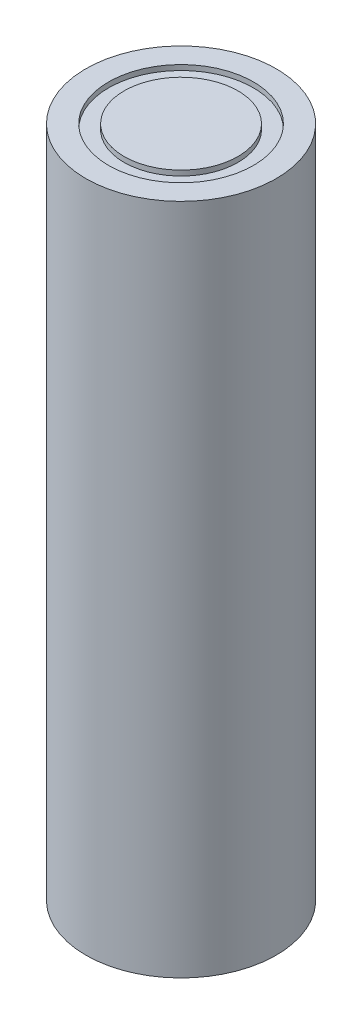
ISO-10303-21;
HEADER;
FILE_DESCRIPTION(('STEP AP214'),'2;1');
FILE_NAME('part.step','',(''),(''),'','','');
FILE_SCHEMA(('AUTOMOTIVE_DESIGN { 1 0 10303 214 1 1 1 1 }'));
ENDSEC;
DATA;
#1=APPLICATION_CONTEXT('core data for automotive mechanical design processes');
#2=APPLICATION_PROTOCOL_DEFINITION('international standard','automotive_design',2000,#1);
#3=PRODUCT_CONTEXT('',#1,'mechanical');
#4=PRODUCT('Part','Part','',(#3));
#5=PRODUCT_RELATED_PRODUCT_CATEGORY('part','',(#4));
#6=PRODUCT_DEFINITION_FORMATION('','',#4);
#7=PRODUCT_DEFINITION_CONTEXT('part definition',#1,'design');
#8=PRODUCT_DEFINITION('design','',#6,#7);
#9=PRODUCT_DEFINITION_SHAPE('','',#8);
#10=(LENGTH_UNIT() NAMED_UNIT(*) SI_UNIT(.MILLI.,.METRE.));
#11=(NAMED_UNIT(*) PLANE_ANGLE_UNIT() SI_UNIT($,.RADIAN.));
#12=(NAMED_UNIT(*) SI_UNIT($,.STERADIAN.) SOLID_ANGLE_UNIT());
#13=UNCERTAINTY_MEASURE_WITH_UNIT(LENGTH_MEASURE(1.E-05),#10,'distance_accuracy_value','');
#14=(GEOMETRIC_REPRESENTATION_CONTEXT(3) GLOBAL_UNCERTAINTY_ASSIGNED_CONTEXT((#13)) GLOBAL_UNIT_ASSIGNED_CONTEXT((#10,
#11,#12)) REPRESENTATION_CONTEXT('',''));
#15=CARTESIAN_POINT('',(0.,0.,0.));
#16=DIRECTION('',(0.,0.,1.));
#17=DIRECTION('',(1.,0.,0.));
#18=AXIS2_PLACEMENT_3D('',#15,#16,#17);
#19=CARTESIAN_POINT('',(0.,32.5,0.));
#20=DIRECTION('',(0.,-1.,0.));
#21=DIRECTION('',(0.,0.,-1.));
#22=AXIS2_PLACEMENT_3D('',#19,#20,#21);
#23=PLANE('',#22);
#24=CARTESIAN_POINT('',(0.,32.5,0.));
#25=DIRECTION('',(0.,1.,0.));
#26=DIRECTION('',(0.,0.,1.));
#27=AXIS2_PLACEMENT_3D('',#24,#25,#26);
#28=CIRCLE('',#27,5.5);
#29=CARTESIAN_POINT('',(0.,32.5,5.5));
#30=VERTEX_POINT('',#29);
#31=EDGE_CURVE('E12',#30,#30,#28,.T.);
#32=ORIENTED_EDGE('',*,*,#31,.T.);
#33=EDGE_LOOP('',(#32));
#34=FACE_BOUND('',#33,.T.);
#35=ADVANCED_FACE('F42',(#34),#23,.F.);
#36=CARTESIAN_POINT('',(0.,-32.5,0.));
#37=DIRECTION('',(0.,1.,0.));
#38=DIRECTION('',(0.,0.,1.));
#39=AXIS2_PLACEMENT_3D('',#36,#37,#38);
#40=CYLINDRICAL_SURFACE('',#39,5.5);
#41=ORIENTED_EDGE('',*,*,#31,.F.);
#42=EDGE_LOOP('',(#41));
#43=FACE_BOUND('',#42,.T.);
#44=CARTESIAN_POINT('',(0.,32.,0.));
#45=DIRECTION('',(0.,1.,0.));
#46=DIRECTION('',(0.,0.,1.));
#47=AXIS2_PLACEMENT_3D('',#44,#45,#46);
#48=CIRCLE('',#47,5.5);
#49=CARTESIAN_POINT('',(0.,32.,5.5));
#50=VERTEX_POINT('',#49);
#51=EDGE_CURVE('E48',#50,#50,#48,.T.);
#52=ORIENTED_EDGE('',*,*,#51,.T.);
#53=EDGE_LOOP('',(#52));
#54=FACE_BOUND('',#53,.T.);
#55=ADVANCED_FACE('F92',(#43,#54),#40,.T.);
#56=CARTESIAN_POINT('',(5.5,32.,0.));
#57=DIRECTION('',(0.,-1.,0.));
#58=DIRECTION('',(0.,0.,-1.));
#59=AXIS2_PLACEMENT_3D('',#56,#57,#58);
#60=PLANE('',#59);
#61=ORIENTED_EDGE('',*,*,#51,.F.);
#62=EDGE_LOOP('',(#61));
#63=FACE_BOUND('',#62,.T.);
#64=CARTESIAN_POINT('',(0.,32.,0.));
#65=DIRECTION('',(0.,1.,0.));
#66=DIRECTION('',(0.,0.,1.));
#67=AXIS2_PLACEMENT_3D('',#64,#65,#66);
#68=CIRCLE('',#67,7.);
#69=CARTESIAN_POINT('',(0.,32.,7.));
#70=VERTEX_POINT('',#69);
#71=EDGE_CURVE('E52',#70,#70,#68,.T.);
#72=ORIENTED_EDGE('',*,*,#71,.T.);
#73=EDGE_LOOP('',(#72));
#74=FACE_BOUND('',#73,.T.);
#75=ADVANCED_FACE('F96',(#63,#74),#60,.F.);
#76=CARTESIAN_POINT('',(0.,-32.5,0.));
#77=DIRECTION('',(0.,1.,0.));
#78=DIRECTION('',(0.,0.,1.));
#79=AXIS2_PLACEMENT_3D('',#76,#77,#78);
#80=CYLINDRICAL_SURFACE('',#79,7.);
#81=ORIENTED_EDGE('',*,*,#71,.F.);
#82=EDGE_LOOP('',(#81));
#83=FACE_BOUND('',#82,.T.);
#84=CARTESIAN_POINT('',(0.,32.5,0.));
#85=DIRECTION('',(0.,1.,0.));
#86=DIRECTION('',(0.,0.,1.));
#87=AXIS2_PLACEMENT_3D('',#84,#85,#86);
#88=CIRCLE('',#87,7.);
#89=CARTESIAN_POINT('',(0.,32.5,7.));
#90=VERTEX_POINT('',#89);
#91=EDGE_CURVE('E56',#90,#90,#88,.T.);
#92=ORIENTED_EDGE('',*,*,#91,.T.);
#93=EDGE_LOOP('',(#92));
#94=FACE_BOUND('',#93,.T.);
#95=ADVANCED_FACE('F101',(#83,#94),#80,.F.);
#96=CARTESIAN_POINT('',(7.,32.5,0.));
#97=DIRECTION('',(0.,-1.,0.));
#98=DIRECTION('',(0.,0.,-1.));
#99=AXIS2_PLACEMENT_3D('',#96,#97,#98);
#100=PLANE('',#99);
#101=ORIENTED_EDGE('',*,*,#91,.F.);
#102=EDGE_LOOP('',(#101));
#103=FACE_BOUND('',#102,.T.);
#104=CARTESIAN_POINT('',(0.,32.5,0.));
#105=DIRECTION('',(0.,1.,0.));
#106=DIRECTION('',(0.,0.,1.));
#107=AXIS2_PLACEMENT_3D('',#104,#105,#106);
#108=CIRCLE('',#107,9.2);
#109=CARTESIAN_POINT('',(0.,32.5,9.2));
#110=VERTEX_POINT('',#109);
#111=EDGE_CURVE('E61',#110,#110,#108,.T.);
#112=ORIENTED_EDGE('',*,*,#111,.T.);
#113=EDGE_LOOP('',(#112));
#114=FACE_BOUND('',#113,.T.);
#115=ADVANCED_FACE('F107',(#103,#114),#100,.F.);
#116=CARTESIAN_POINT('',(0.,-32.5,0.));
#117=DIRECTION('',(0.,1.,0.));
#118=DIRECTION('',(0.,0.,1.));
#119=AXIS2_PLACEMENT_3D('',#116,#117,#118);
#120=CYLINDRICAL_SURFACE('',#119,9.2);
#121=ORIENTED_EDGE('',*,*,#111,.F.);
#122=EDGE_LOOP('',(#121));
#123=FACE_BOUND('',#122,.T.);
#124=CARTESIAN_POINT('',(0.,-32.5,0.));
#125=DIRECTION('',(0.,1.,0.));
#126=DIRECTION('',(0.,0.,1.));
#127=AXIS2_PLACEMENT_3D('',#124,#125,#126);
#128=CIRCLE('',#127,9.2);
#129=CARTESIAN_POINT('',(0.,-32.5,9.2));
#130=VERTEX_POINT('',#129);
#131=EDGE_CURVE('E64',#130,#130,#128,.T.);
#132=ORIENTED_EDGE('',*,*,#131,.T.);
#133=EDGE_LOOP('',(#132));
#134=FACE_BOUND('',#133,.T.);
#135=ADVANCED_FACE('F111',(#123,#134),#120,.T.);
#136=CARTESIAN_POINT('',(9.2,-32.5,0.));
#137=DIRECTION('',(0.,1.,0.));
#138=DIRECTION('',(0.,0.,1.));
#139=AXIS2_PLACEMENT_3D('',#136,#137,#138);
#140=PLANE('',#139);
#141=ORIENTED_EDGE('',*,*,#131,.F.);
#142=EDGE_LOOP('',(#141));
#143=FACE_BOUND('',#142,.T.);
#144=CARTESIAN_POINT('',(0.,-32.5,0.));
#145=DIRECTION('',(0.,1.,0.));
#146=DIRECTION('',(0.,0.,1.));
#147=AXIS2_PLACEMENT_3D('',#144,#145,#146);
#148=CIRCLE('',#147,7.4);
#149=CARTESIAN_POINT('',(0.,-32.5,7.4));
#150=VERTEX_POINT('',#149);
#151=EDGE_CURVE('E67',#150,#150,#148,.T.);
#152=ORIENTED_EDGE('',*,*,#151,.T.);
#153=EDGE_LOOP('',(#152));
#154=FACE_BOUND('',#153,.T.);
#155=ADVANCED_FACE('F115',(#143,#154),#140,.F.);
#156=CARTESIAN_POINT('',(0.,-32.5,0.));
#157=DIRECTION('',(0.,1.,0.));
#158=DIRECTION('',(0.,0.,1.));
#159=AXIS2_PLACEMENT_3D('',#156,#157,#158);
#160=CYLINDRICAL_SURFACE('',#159,7.4);
#161=ORIENTED_EDGE('',*,*,#151,.F.);
#162=EDGE_LOOP('',(#161));
#163=FACE_BOUND('',#162,.T.);
#164=CARTESIAN_POINT('',(0.,-32.3,0.));
#165=DIRECTION('',(0.,1.,0.));
#166=DIRECTION('',(0.,0.,1.));
#167=AXIS2_PLACEMENT_3D('',#164,#165,#166);
#168=CIRCLE('',#167,7.4);
#169=CARTESIAN_POINT('',(0.,-32.3,7.4));
#170=VERTEX_POINT('',#169);
#171=EDGE_CURVE('E70',#170,#170,#168,.T.);
#172=ORIENTED_EDGE('',*,*,#171,.T.);
#173=EDGE_LOOP('',(#172));
#174=FACE_BOUND('',#173,.T.);
#175=ADVANCED_FACE('F119',(#163,#174),#160,.F.);
#176=CARTESIAN_POINT('',(7.4,-32.3,0.));
#177=DIRECTION('',(0.,1.,0.));
#178=DIRECTION('',(0.,0.,1.));
#179=AXIS2_PLACEMENT_3D('',#176,#177,#178);
#180=PLANE('',#179);
#181=ORIENTED_EDGE('',*,*,#171,.F.);
#182=EDGE_LOOP('',(#181));
#183=FACE_BOUND('',#182,.T.);
#184=CARTESIAN_POINT('',(0.,-32.3,0.));
#185=DIRECTION('',(0.,1.,0.));
#186=DIRECTION('',(0.,0.,1.));
#187=AXIS2_PLACEMENT_3D('',#184,#185,#186);
#188=CIRCLE('',#187,7.2);
#189=CARTESIAN_POINT('',(0.,-32.3,7.2));
#190=VERTEX_POINT('',#189);
#191=EDGE_CURVE('E73',#190,#190,#188,.T.);
#192=ORIENTED_EDGE('',*,*,#191,.T.);
#193=EDGE_LOOP('',(#192));
#194=FACE_BOUND('',#193,.T.);
#195=ADVANCED_FACE('F88',(#183,#194),#180,.F.);
#196=CARTESIAN_POINT('',(0.,-32.5,0.));
#197=DIRECTION('',(0.,1.,0.));
#198=DIRECTION('',(0.,0.,1.));
#199=AXIS2_PLACEMENT_3D('',#196,#197,#198);
#200=CYLINDRICAL_SURFACE('',#199,7.2);
#201=ORIENTED_EDGE('',*,*,#191,.F.);
#202=EDGE_LOOP('',(#201));
#203=FACE_BOUND('',#202,.T.);
#204=CARTESIAN_POINT('',(0.,-32.5,0.));
#205=DIRECTION('',(0.,1.,0.));
#206=DIRECTION('',(0.,0.,1.));
#207=AXIS2_PLACEMENT_3D('',#204,#205,#206);
#208=CIRCLE('',#207,7.2);
#209=CARTESIAN_POINT('',(0.,-32.5,7.2));
#210=VERTEX_POINT('',#209);
#211=EDGE_CURVE('E76',#210,#210,#208,.T.);
#212=ORIENTED_EDGE('',*,*,#211,.T.);
#213=EDGE_LOOP('',(#212));
#214=FACE_BOUND('',#213,.T.);
#215=ADVANCED_FACE('F80',(#203,#214),#200,.T.);
#216=CARTESIAN_POINT('',(7.2,-32.5,0.));
#217=DIRECTION('',(0.,1.,0.));
#218=DIRECTION('',(0.,0.,1.));
#219=AXIS2_PLACEMENT_3D('',#216,#217,#218);
#220=PLANE('',#219);
#221=ORIENTED_EDGE('',*,*,#211,.F.);
#222=EDGE_LOOP('',(#221));
#223=FACE_BOUND('',#222,.T.);
#224=ADVANCED_FACE('F82',(#223),#220,.F.);
#225=CLOSED_SHELL('',(#35,#55,#75,#95,#115,#135,#155,#175,#195,#215,#224));
#226=MANIFOLD_SOLID_BREP('B2',#225);
#227=ADVANCED_BREP_SHAPE_REPRESENTATION('',(#18,#226),#14);
#228=SHAPE_DEFINITION_REPRESENTATION(#9,#227);
ENDSEC;
END-ISO-10303-21;
